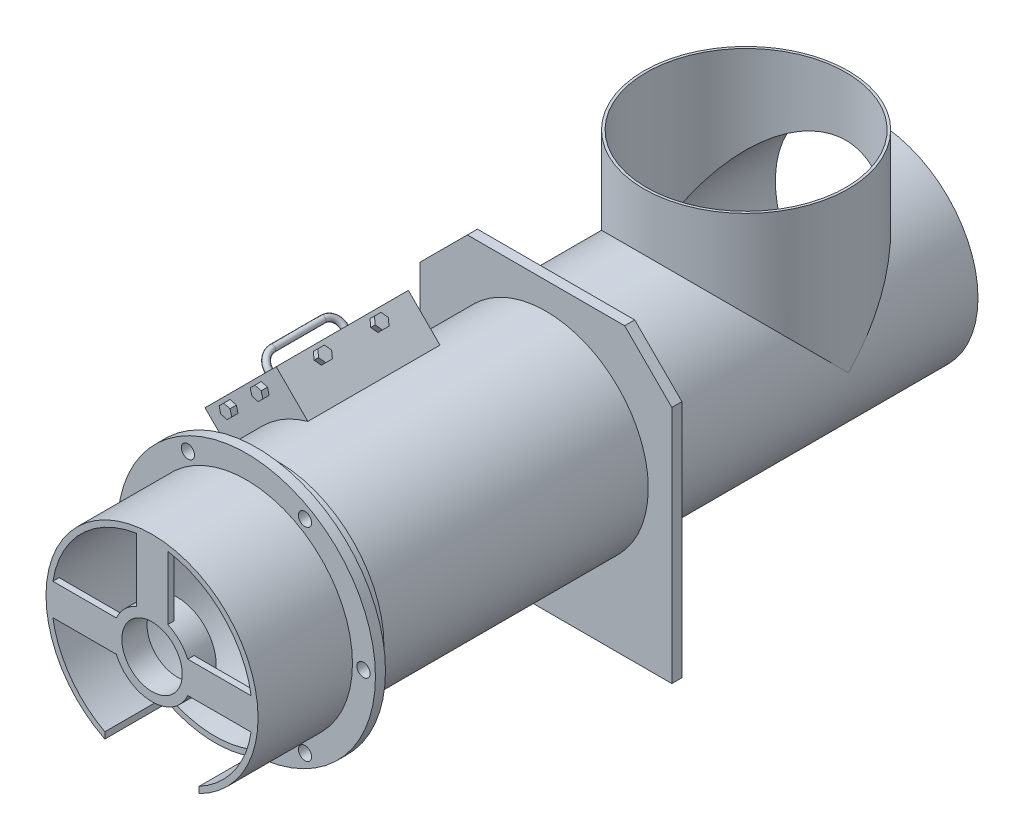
from build123d import *

# Parameters (mm, degrees)
SKETCH1_R                 = 162.5
SKETCH1_R_2               = 159.5
BOSS_EXTRUDE1_DEPTH       = 950
SKETCH2_W                 = 150
SKETCH2_H                 = 100
CUT_EXTRUDE1_DEPTH        = 1186.980606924
SKETCH11_R                = 10.5
CUT_EXTRUDE4_DEPTH        = 16
CIRPATTERN2_COUNT         = 6
SKETCH13_W                = 400
SKETCH13_H                = 455
SKETCH13_R                = 162.5
BOSS_EXTRUDE3_DEPTH       = 16
CHAMFER1_SIZE             = 75
SKETCH14_W                = 40
SKETCH14_H                = 14
BOSS_EXTRUDE4_START       = -10
BOSS_EXTRUDE4_DEPTH       = 10
CIRPATTERN3_COUNT         = 4
BOSS_EXTRUDE5_REACH       = 1270.431
BOSS_EXTRUDE5_END_RADIUS  = 162.5
SKETCH16_W                = 210
SKETCH16_H                = 160
SKETCH16_W_2              = 202
SKETCH16_H_2              = 152
BOSS_EXTRUDE6_REACH       = 1270.431
BOSS_EXTRUDE6_END_RADIUS  = 162.5
SKETCH18_W                = 200
SKETCH18_H                = 150
SKETCH18_W_2              = 192
SKETCH18_H_2              = 142
SKETCH19_R                = 5
BOSS_EXTRUDE7_DEPTH       = 10
LPATTERN1_COUNT           = 2
LPATTERN1_PITCH           = 19
SKETCH22_R                = 5
BOSS_EXTRUDE8_DEPTH       = 10
LPATTERN2_COUNT           = 2
LPATTERN2_PITCH           = 90
LPATTERN2_COPY_1_DEPTH    = 10
BOSS_EXTRUDE9_DEPTH       = 10
LPATTERN3_COUNT           = 2
LPATTERN3_PITCH           = 19
SKETCH24_R                = 5
BOSS_EXTRUDE10_DEPTH      = 10
LPATTERN4_COUNT           = 2
LPATTERN4_PITCH           = 70
LPATTERN4_COPY_1_DEPTH    = 10
MIRROR1_COPY_1_DEPTH      = 10
MIRROR1_COPY_2_DEPTH      = 10
MIRROR1_COPY_3_SKETCH_R   = 5
MIRROR1_COPY_3_DEPTH      = 10
MIRROR1_COPY_4_DEPTH      = 10
MIRROR2_COPY_1_DEPTH      = 10
MIRROR2_COPY_2_DEPTH      = 10
MIRROR2_COPY_3_SKETCH_R   = 5
MIRROR2_COPY_3_DEPTH      = 10
MIRROR2_COPY_4_DEPTH      = 10
BOSS_EXTRUDE11_REACH      = 1274.582
BOSS_EXTRUDE11_END_RADIUS = 162.5
SKETCH4_R                 = 162.5
CUT_EXTRUDE5_REACH        = 1274.582
CUT_EXTRUDE5_END_RADIUS   = 159.5
SKETCH25_R                = 158.5


with BuildPart() as part:
    # Sketch1 → Boss-Extrude1 (new body)
    with BuildSketch(Plane.XY):
        with Locations(Location((0, 0, 0), (0, 0, 180))):
            Circle(SKETCH1_R)
        with Locations(Location((0, 0, 0), (0, 0, 180))):
            Circle(SKETCH1_R_2, mode=Mode.SUBTRACT)
    extrude(amount=BOSS_EXTRUDE1_DEPTH)

    # Sketch8 → Revolve2 (revolve)
    with BuildSketch(Plane(origin=(0, 0, 0), x_dir=(0, 0, -1), z_dir=(1, 0, 0)), mode=Mode.PRIVATE) as revolve2_sk:
        Polygon((-950, 159.5), (-1150, 159.5), (-1150, 168.5), (-1000, 168.5), (-1000, 205), (-984, 205), (-984, 168.5), (-950, 168.5), align=None)
    revolve(revolve2_sk.sketch.rotate(Axis((0, 0, 950), (0, 0, -1)), 90), axis=Axis((0, 0, 950), (0, 0, -1)))

    # Sketch2 → Cut-Extrude1 (cut, through all)
    with BuildSketch(Plane(origin=(0, 0, 0), x_dir=(1, 0, 0), z_dir=(0, 1, 0))):
        with Locations((0, -1100)):
            Rectangle(SKETCH2_W, SKETCH2_H)
    extrude(amount=-CUT_EXTRUDE1_DEPTH, mode=Mode.SUBTRACT)

    # Sketch11 → Cut-Extrude4 (cut)
    with BuildSketch(Plane.XY.offset(1000)):
        with Locations((186, 0)):
            Circle(SKETCH11_R)
    cut_extrude4 = extrude(amount=-CUT_EXTRUDE4_DEPTH, mode=Mode.SUBTRACT)

    # CirPattern2: Cut-Extrude4 ×6 about axis
    cirpattern2_axis = Axis((0, 0, 0), (0, 0, 1))
    for i in range(1, CIRPATTERN2_COUNT):
        add(cut_extrude4.rotate(cirpattern2_axis, i * 360 / CIRPATTERN2_COUNT), mode=Mode.SUBTRACT)



with BuildPart() as body_2:
    # Sketch13 → Boss-Extrude3 (new body)
    with BuildSketch(Plane(origin=(0, 0, 524), x_dir=(-1, 0, 0), z_dir=(0, 0, -1))):
        with Locations((0, -22.5)):
            Rectangle(SKETCH13_W, SKETCH13_H)
        Circle(SKETCH13_R, mode=Mode.SUBTRACT)
    extrude(amount=BOSS_EXTRUDE3_DEPTH)

    # Chamfer1
    chamfer1_edges = [body_2.edges().sort_by_distance(p)[0] for p in [
        (200, 205, 516),
        (-200, 205, 516),
    ]]
    chamfer(chamfer1_edges, length=CHAMFER1_SIZE)


with BuildPart() as body_3:
    # Sketch14 → Revolve3 (revolve)
    with BuildSketch(Plane(origin=(0, 0, 0), x_dir=(0, 0, -1), z_dir=(1, 0, 0)), mode=Mode.PRIVATE) as revolve3_sk:
        with Locations((-1130, 55)):
            Rectangle(SKETCH14_W, SKETCH14_H)
    revolve(revolve3_sk.sketch.rotate(Axis((0, 0, 950), (0, 0, -1)), 90), axis=Axis((0, 0, 950), (0, 0, -1)))


with BuildPart() as part_1:
    add(part.part)

    add(body_3.part)  # Boss-Extrude4 merges body 3
    # Sketch15 → Boss-Extrude4 (add)
    with BuildSketch(Plane.XY.offset(1150).offset(BOSS_EXTRUDE4_START)):
        with BuildLine():
            Line((56.73623181, -25), (157.528568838, -25))
            ThreePointArc((157.528568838, -25), (159.5, 0), (157.528568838, 25))
            Line((157.528568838, 25), (56.73623181, 25))
            ThreePointArc((56.73623181, 25), (62, 0), (56.73623181, -25))
        make_face()
    boss_extrude4 = extrude(amount=BOSS_EXTRUDE4_DEPTH)

    # CirPattern3: Boss-Extrude4 ×4 about axis, 1 skipped
    cirpattern3_axis = Axis((0, 0, 950), (0, 0, -1))
    add([boss_extrude4.rotate(cirpattern3_axis, i * 360 / CIRPATTERN3_COUNT) for i in range(1, CIRPATTERN3_COUNT) if i not in (1,)])



with BuildPart() as body_3_2:
    # Boss-Extrude5: up to this cylinder (the profile starts outside it)
    boss_extrude5_end = Plane(origin=(0, 0, 754), z_dir=(0, 0, -1)) * Cylinder(BOSS_EXTRUDE5_END_RADIUS, 2866.862, mode=Mode.PRIVATE)
    # Sketch16 → Boss-Extrude5 (new, up to the surface)
    with BuildSketch(Plane(origin=(-150.260191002, 150.260191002, 0), x_dir=(0, 0, -1), z_dir=(-0.7071067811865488, 0.7071067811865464, 0)), mode=Mode.PRIVATE) as boss_extrude5_sk1:
        with Locations((-754, 0)):
            Rectangle(SKETCH16_W, SKETCH16_H)
        with Locations((-754, 0)):
            Rectangle(SKETCH16_W_2, SKETCH16_H_2, mode=Mode.SUBTRACT)
    boss_extrude5_tool1 = extrude(boss_extrude5_sk1.sketch, amount=-BOSS_EXTRUDE5_REACH, mode=Mode.PRIVATE) - boss_extrude5_end
    add(boss_extrude5_tool1.solids().sort_by_distance((-95.558464, 204.961918, 754))[0])


with BuildPart() as body_4:
    # Boss-Extrude6: up to this cylinder (the profile starts outside it)
    boss_extrude6_end = Plane(origin=(0, 0, 754), z_dir=(0, 0, -1)) * Cylinder(BOSS_EXTRUDE6_END_RADIUS, 2866.862, mode=Mode.PRIVATE)
    # Sketch18 → Boss-Extrude6 (new, up to the surface)
    with BuildSketch(Plane(origin=(-150.260191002, 150.260191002, 0), x_dir=(0, 0, -1), z_dir=(-0.7071067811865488, 0.7071067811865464, 0)), mode=Mode.PRIVATE) as boss_extrude6_sk1:
        with Locations((-754, 0)):
            Rectangle(SKETCH18_W, SKETCH18_H)
        with Locations((-754, 0)):
            Rectangle(SKETCH18_W_2, SKETCH18_H_2, mode=Mode.SUBTRACT)
    boss_extrude6_tool1 = extrude(boss_extrude6_sk1.sketch, amount=-BOSS_EXTRUDE6_REACH, mode=Mode.PRIVATE) - boss_extrude6_end
    add(boss_extrude6_tool1.solids().sort_by_distance((-201.525433, 98.994949, 754))[0])


with BuildPart() as body_5:
    # Sweep1: sweep along a path in Sketch20
    with BuildLine(Plane(origin=(0, 0, 0), x_dir=(0.7071067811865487, -0.7071067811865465, 0), z_dir=(0.7071067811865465, 0.7071067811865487, 0))) as sweep1_path:
        Line((-162.5, -814), (-212.5, -814))
        ThreePointArc((-212.5, -814), (-226.642135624, -808.142135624), (-232.5, -794))
        Line((-232.5, -794), (-232.5, -714))
        ThreePointArc((-232.5, -714), (-226.642135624, -699.857864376), (-212.5, -694))
        Line((-212.5, -694), (-162.5, -694))
    # Sketch19 → Sweep1 (sweep)
    with BuildSketch(Plane(origin=(-114.904851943, 114.904851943, 0), x_dir=(0, 0, -1), z_dir=(-0.7071067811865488, 0.7071067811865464, 0))):
        with Locations((-814, 0)):
            Circle(SKETCH19_R)
    sweep(path=sweep1_path.line)


with BuildPart() as part_2:
    add(part_1.part)

    add(body_3_2.part)  # Boss-Extrude7 merges body 3 2

    add(body_4.part)  # Boss-Extrude7 merges body 4
    # Sketch21 → Boss-Extrude7 (add)
    with BuildSketch(Plane(origin=(56.568542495, 56.568542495, 0), x_dir=(0, 0, -1), z_dir=(0.7071067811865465, 0.7071067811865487, 0))):
        Polygon((-793.803847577, 188.5), (-788.607695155, 197.5), (-793.803847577, 206.5), (-804.196152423, 206.5), (-809.392304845, 197.5), (-804.196152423, 188.5), align=None)
    boss_extrude7 = extrude(amount=BOSS_EXTRUDE7_DEPTH)

    # LPattern1: Boss-Extrude7 ×2
    with Locations(*[Vector(-0.7071067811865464, -0.7071067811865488, 0) * (i * LPATTERN1_PITCH) for i in range(1, LPATTERN1_COUNT)]):
        add(boss_extrude7)

    # Sketch22 → Boss-Extrude8 (add)
    with BuildSketch(Plane(origin=(43.133513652, 43.133513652, 0), x_dir=(0, 0, 1), z_dir=(-0.707106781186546, -0.707106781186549, 0))):
        with Locations(Location((799, 197.5, 0), (0, 0, 90))):
            Circle(SKETCH22_R)
    boss_extrude8 = extrude(amount=BOSS_EXTRUDE8_DEPTH)

    # LPattern2: Boss-Extrude7, Boss-Extrude8 ×2
    with Locations(*[(0, 0, -i * LPATTERN2_PITCH) for i in range(1, LPATTERN2_COUNT)]):
        add(boss_extrude7)
        add(boss_extrude8)

    # LPattern2 copy 1 sketch → LPattern2 copy 1 (add)
    with BuildSketch(Plane(origin=(43.133513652, 43.133513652, -90), x_dir=(0, 0, -1), z_dir=(0.7071067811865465, 0.7071067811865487, 0))):
        Polygon((-793.803847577, 188.5), (-788.607695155, 197.5), (-793.803847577, 206.5), (-804.196152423, 206.5), (-809.392304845, 197.5), (-804.196152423, 188.5), align=None)
    extrude(amount=LPATTERN2_COPY_1_DEPTH)

    # Sketch23 → Boss-Extrude9 (add)
    with BuildSketch(Plane.XY.offset(859)):
        Polygon((-124.943047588, 167.092053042), (-122.253321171, 157.053857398), (-112.215125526, 154.364130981), (-104.866656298, 161.712600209), (-107.556382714, 171.750795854), (-117.594578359, 174.440522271), align=None)
    boss_extrude9 = extrude(amount=BOSS_EXTRUDE9_DEPTH)

    # LPattern3: Boss-Extrude9 ×2
    with Locations(*[(0, 0, -i * LPATTERN3_PITCH) for i in range(1, LPATTERN3_COUNT)]):
        add(boss_extrude9)

    # Sketch24 → Boss-Extrude10 (add)
    with BuildSketch(Plane(origin=(0, 0, 840), x_dir=(-1, 0, 0), z_dir=(0, 0, -1))):
        with Locations(Location((114.904851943, 164.402326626, 0), (0, 0, 180))):
            Circle(SKETCH24_R)
    boss_extrude10 = extrude(amount=BOSS_EXTRUDE10_DEPTH)

    # LPattern4: Boss-Extrude9, Boss-Extrude10 ×2
    with Locations(*[Vector(-0.7071067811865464, -0.7071067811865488, 0) * (i * LPATTERN4_PITCH) for i in range(1, LPATTERN4_COUNT)]):
        add(boss_extrude9)
        add(boss_extrude10)

    # LPattern4 copy 1 sketch → LPattern4 copy 1 (add)
    with BuildSketch(Plane(origin=(-49.497474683, -49.497474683, 840), x_dir=(1, 0, 0), z_dir=(0, 0, 1))):
        Polygon((-124.943047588, 167.092053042), (-122.253321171, 157.053857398), (-112.215125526, 154.364130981), (-104.866656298, 161.712600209), (-107.556382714, 171.750795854), (-117.594578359, 174.440522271), align=None)
    extrude(amount=LPATTERN4_COPY_1_DEPTH)

    # Mirror1: Boss-Extrude7, Boss-Extrude8 across plane
    add(boss_extrude7.mirror(Plane(origin=(0, 0, 0), x_dir=(0, 0, 1), z_dir=(0.7071067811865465, 0.7071067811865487, 0))))
    add(boss_extrude8.mirror(Plane(origin=(0, 0, 0), x_dir=(0, 0, 1), z_dir=(0.7071067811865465, 0.7071067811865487, 0))))

    # Mirror1 copy 1 sketch → Mirror1 copy 1 (add)
    with BuildSketch(Plane(origin=(-43.133513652, -43.133513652, 0), x_dir=(0, 0, -1), z_dir=(-0.7071067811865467, -0.7071067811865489, 0))):
        Polygon((-793.803847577, -188.5), (-788.607695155, -197.5), (-793.803847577, -206.5), (-804.196152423, -206.5), (-809.392304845, -197.5), (-804.196152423, -188.5), align=None)
    extrude(amount=MIRROR1_COPY_1_DEPTH)

    # Mirror1 copy 2 sketch → Mirror1 copy 2 (add)
    with BuildSketch(Plane(origin=(-56.568542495, -56.568542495, -90), x_dir=(0, 0, -1), z_dir=(-0.7071067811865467, -0.7071067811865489, 0))):
        Polygon((-793.803847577, -188.5), (-788.607695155, -197.5), (-793.803847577, -206.5), (-804.196152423, -206.5), (-809.392304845, -197.5), (-804.196152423, -188.5), align=None)
    extrude(amount=MIRROR1_COPY_2_DEPTH)



with BuildPart() as body_4_2:
    # Mirror1 copy 3 sketch → Mirror1 copy 3 (new body)
    with BuildSketch(Plane(origin=(-43.133513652, -43.133513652, -90), x_dir=(0, 0, 1), z_dir=(0.707106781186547, 0.7071067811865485, 0))):
        with Locations((799, -197.5)):
            Circle(MIRROR1_COPY_3_SKETCH_R)
    extrude(amount=MIRROR1_COPY_3_DEPTH)


with BuildPart() as part_3:
    add(part_2.part)

    add(body_4_2.part)  # Mirror1 copy 4 merges body 4 2
    # Mirror1 copy 4 sketch → Mirror1 copy 4 (add)
    with BuildSketch(Plane(origin=(-43.133513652, -43.133513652, -90), x_dir=(0, 0, -1), z_dir=(-0.7071067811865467, -0.7071067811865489, 0))):
        Polygon((-793.803847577, -188.5), (-788.607695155, -197.5), (-793.803847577, -206.5), (-804.196152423, -206.5), (-809.392304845, -197.5), (-804.196152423, -188.5), align=None)
    extrude(amount=MIRROR1_COPY_4_DEPTH)

    # Mirror2: Boss-Extrude9, Boss-Extrude10 across plane
    add(boss_extrude9.mirror(Plane.XY.offset(754)))
    add(boss_extrude10.mirror(Plane.XY.offset(754)))

    # Mirror2 copy 1 sketch → Mirror2 copy 1 (add)
    with BuildSketch(Plane(origin=(0, 0, 668), x_dir=(1, 0, 0), z_dir=(0, 0, -1))):
        Polygon((-124.943047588, -167.092053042), (-122.253321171, -157.053857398), (-112.215125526, -154.364130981), (-104.866656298, -161.712600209), (-107.556382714, -171.750795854), (-117.594578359, -174.440522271), align=None)
    extrude(amount=MIRROR2_COPY_1_DEPTH)

    # Mirror2 copy 2 sketch → Mirror2 copy 2 (add)
    with BuildSketch(Plane(origin=(-49.497474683, -49.497474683, 649), x_dir=(1, 0, 0), z_dir=(0, 0, -1))):
        Polygon((-124.943047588, -167.092053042), (-122.253321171, -157.053857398), (-112.215125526, -154.364130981), (-104.866656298, -161.712600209), (-107.556382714, -171.750795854), (-117.594578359, -174.440522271), align=None)
    extrude(amount=MIRROR2_COPY_2_DEPTH)



with BuildPart() as body_4_3:
    # Mirror2 copy 3 sketch → Mirror2 copy 3 (new body)
    with BuildSketch(Plane(origin=(-49.497474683, -49.497474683, 668), x_dir=(-1, 0, 0), z_dir=(0, 0, 1))):
        with Locations((114.904851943, -164.402326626)):
            Circle(MIRROR2_COPY_3_SKETCH_R)
    extrude(amount=MIRROR2_COPY_3_DEPTH)


with BuildPart() as part_4:
    add(part_3.part)

    add(body_4_3.part)  # Mirror2 copy 4 merges body 4 3
    # Mirror2 copy 4 sketch → Mirror2 copy 4 (add)
    with BuildSketch(Plane(origin=(-49.497474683, -49.497474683, 668), x_dir=(1, 0, 0), z_dir=(0, 0, -1))):
        Polygon((-124.943047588, -167.092053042), (-122.253321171, -157.053857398), (-112.215125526, -154.364130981), (-104.866656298, -161.712600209), (-107.556382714, -171.750795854), (-117.594578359, -174.440522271), align=None)
    extrude(amount=MIRROR2_COPY_4_DEPTH)

    # Boss-Extrude11: up to this cylinder (the profile starts outside it)
    boss_extrude11_end = Plane(origin=(0, 0, 206), z_dir=(0, 0, -1)) * Cylinder(BOSS_EXTRUDE11_END_RADIUS, 2875.164, mode=Mode.PRIVATE)
    # Sketch4 → Boss-Extrude11 (add, up to the surface)
    with BuildSketch(Plane(origin=(0, 253, 0), x_dir=(1, 0, 0), z_dir=(0, 1, 0)), mode=Mode.PRIVATE) as boss_extrude11_sk1:
        with Locations(Location((0, -206, 0), (0, 0, 270))):
            Circle(SKETCH4_R)
    boss_extrude11_tool1 = extrude(boss_extrude11_sk1.sketch, amount=-BOSS_EXTRUDE11_REACH, mode=Mode.PRIVATE) - boss_extrude11_end
    add(boss_extrude11_tool1.solids().sort_by_distance((0, 253, 206))[0])

    # Cut-Extrude5: up to this cylinder (the profile starts outside it)
    cut_extrude5_end = Plane(origin=(0, 0, 206), z_dir=(0, 0, -1)) * Cylinder(CUT_EXTRUDE5_END_RADIUS, 2869.164, mode=Mode.PRIVATE)
    # Sketch25 → Cut-Extrude5 (cut, up to the surface)
    with BuildSketch(Plane(origin=(0, 253, 0), x_dir=(1, 0, 0), z_dir=(0, 1, 0)), mode=Mode.PRIVATE) as cut_extrude5_sk1:
        with Locations(Location((0, -206, 0), (0, 0, 270))):
            Circle(SKETCH25_R)
    cut_extrude5_tool1 = extrude(cut_extrude5_sk1.sketch, amount=-CUT_EXTRUDE5_REACH, mode=Mode.PRIVATE) - cut_extrude5_end
    add(cut_extrude5_tool1.solids().sort_by_distance((0, 253, 206))[0], mode=Mode.SUBTRACT)


solid = Compound([body_2.part, body_5.part, part_4.part])
